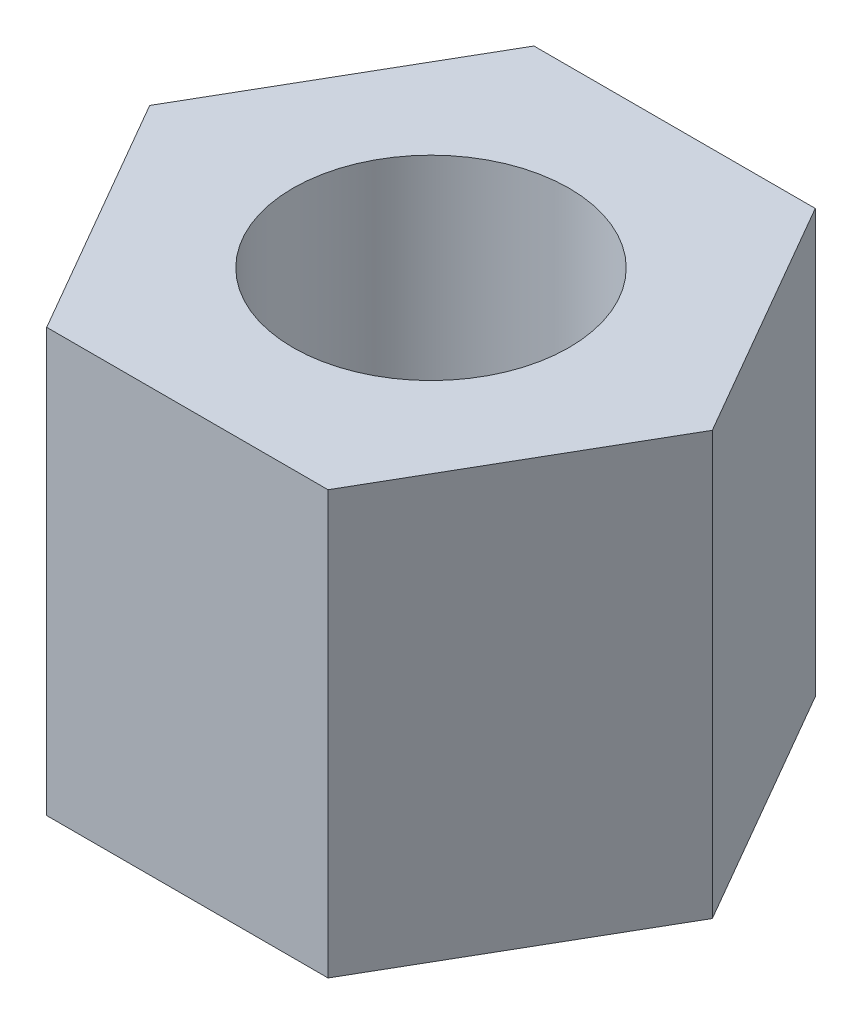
ISO-10303-21;
HEADER;
FILE_DESCRIPTION(('STEP AP214'),'2;1');
FILE_NAME('part.step','',(''),(''),'','','');
FILE_SCHEMA(('AUTOMOTIVE_DESIGN { 1 0 10303 214 1 1 1 1 }'));
ENDSEC;
DATA;
#1=APPLICATION_CONTEXT('core data for automotive mechanical design processes');
#2=APPLICATION_PROTOCOL_DEFINITION('international standard','automotive_design',2000,#1);
#3=PRODUCT_CONTEXT('',#1,'mechanical');
#4=PRODUCT('Part','Part','',(#3));
#5=PRODUCT_RELATED_PRODUCT_CATEGORY('part','',(#4));
#6=PRODUCT_DEFINITION_FORMATION('','',#4);
#7=PRODUCT_DEFINITION_CONTEXT('part definition',#1,'design');
#8=PRODUCT_DEFINITION('design','',#6,#7);
#9=PRODUCT_DEFINITION_SHAPE('','',#8);
#10=(LENGTH_UNIT() NAMED_UNIT(*) SI_UNIT(.MILLI.,.METRE.));
#11=(NAMED_UNIT(*) PLANE_ANGLE_UNIT() SI_UNIT($,.RADIAN.));
#12=(NAMED_UNIT(*) SI_UNIT($,.STERADIAN.) SOLID_ANGLE_UNIT());
#13=UNCERTAINTY_MEASURE_WITH_UNIT(LENGTH_MEASURE(1.E-05),#10,'distance_accuracy_value','');
#14=(GEOMETRIC_REPRESENTATION_CONTEXT(3) GLOBAL_UNCERTAINTY_ASSIGNED_CONTEXT((#13)) GLOBAL_UNIT_ASSIGNED_CONTEXT((#10,
#11,#12)) REPRESENTATION_CONTEXT('',''));
#15=CARTESIAN_POINT('',(0.,0.,0.));
#16=DIRECTION('',(0.,0.,1.));
#17=DIRECTION('',(1.,0.,0.));
#18=AXIS2_PLACEMENT_3D('',#15,#16,#17);
#19=CARTESIAN_POINT('',(6.92820323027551,0.,0.));
#20=DIRECTION('',(0.,-1.,0.));
#21=DIRECTION('',(0.,0.,-1.));
#22=AXIS2_PLACEMENT_3D('',#19,#20,#21);
#23=PLANE('',#22);
#24=DIRECTION('',(-0.5,0.,-0.866025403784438));
#25=VECTOR('',#24,1.);
#26=CARTESIAN_POINT('',(6.92820323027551,0.,0.));
#27=LINE('',#26,#25);
#28=CARTESIAN_POINT('',(6.92820323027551,0.,0.));
#29=VERTEX_POINT('',#28);
#30=CARTESIAN_POINT('',(3.46410161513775,0.,-6.));
#31=VERTEX_POINT('',#30);
#32=EDGE_CURVE('E119',#29,#31,#27,.T.);
#33=ORIENTED_EDGE('',*,*,#32,.F.);
#34=DIRECTION('',(0.5,0.,-0.866025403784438));
#35=VECTOR('',#34,1.);
#36=CARTESIAN_POINT('',(3.46410161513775,0.,6.));
#37=LINE('',#36,#35);
#38=CARTESIAN_POINT('',(3.46410161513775,0.,6.));
#39=VERTEX_POINT('',#38);
#40=EDGE_CURVE('E80',#39,#29,#37,.T.);
#41=ORIENTED_EDGE('',*,*,#40,.F.);
#42=DIRECTION('',(1.,0.,0.));
#43=VECTOR('',#42,1.);
#44=CARTESIAN_POINT('',(-3.46410161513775,0.,6.));
#45=LINE('',#44,#43);
#46=CARTESIAN_POINT('',(-3.46410161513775,0.,6.));
#47=VERTEX_POINT('',#46);
#48=EDGE_CURVE('E74',#47,#39,#45,.T.);
#49=ORIENTED_EDGE('',*,*,#48,.F.);
#50=DIRECTION('',(0.5,0.,0.866025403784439));
#51=VECTOR('',#50,1.);
#52=CARTESIAN_POINT('',(-6.92820323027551,0.,0.));
#53=LINE('',#52,#51);
#54=CARTESIAN_POINT('',(-6.92820323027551,0.,0.));
#55=VERTEX_POINT('',#54);
#56=EDGE_CURVE('E109',#55,#47,#53,.T.);
#57=ORIENTED_EDGE('',*,*,#56,.F.);
#58=DIRECTION('',(-0.5,0.,0.866025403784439));
#59=VECTOR('',#58,1.);
#60=CARTESIAN_POINT('',(-3.46410161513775,0.,-6.));
#61=LINE('',#60,#59);
#62=CARTESIAN_POINT('',(-3.46410161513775,0.,-6.));
#63=VERTEX_POINT('',#62);
#64=EDGE_CURVE('E125',#63,#55,#61,.T.);
#65=ORIENTED_EDGE('',*,*,#64,.F.);
#66=DIRECTION('',(-1.,0.,0.));
#67=VECTOR('',#66,1.);
#68=CARTESIAN_POINT('',(3.46410161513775,0.,-6.));
#69=LINE('',#68,#67);
#70=EDGE_CURVE('E122',#31,#63,#69,.T.);
#71=ORIENTED_EDGE('',*,*,#70,.F.);
#72=EDGE_LOOP('',(#33,#41,#49,#57,#65,#71));
#73=FACE_BOUND('',#72,.T.);
#74=CARTESIAN_POINT('',(0.,0.,0.));
#75=DIRECTION('',(0.,1.,0.));
#76=DIRECTION('',(0.,0.,1.));
#77=AXIS2_PLACEMENT_3D('',#74,#75,#76);
#78=CIRCLE('',#77,3.4);
#79=CARTESIAN_POINT('',(0.,0.,3.4));
#80=VERTEX_POINT('',#79);
#81=EDGE_CURVE('E168',#80,#80,#78,.T.);
#82=ORIENTED_EDGE('',*,*,#81,.T.);
#83=EDGE_LOOP('',(#82));
#84=FACE_BOUND('',#83,.T.);
#85=ADVANCED_FACE('F34',(#73,#84),#23,.T.);
#86=CARTESIAN_POINT('',(6.92820323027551,10.414,0.));
#87=DIRECTION('',(-0.866025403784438,0.,0.5));
#88=DIRECTION('',(0.5,0.,0.866025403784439));
#89=AXIS2_PLACEMENT_3D('',#86,#87,#88);
#90=PLANE('',#89);
#91=ORIENTED_EDGE('',*,*,#32,.T.);
#92=DIRECTION('',(0.,-1.,0.));
#93=VECTOR('',#92,1.);
#94=CARTESIAN_POINT('',(3.46410161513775,10.414,-6.));
#95=LINE('',#94,#93);
#96=CARTESIAN_POINT('',(3.46410161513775,10.414,-6.));
#97=VERTEX_POINT('',#96);
#98=EDGE_CURVE('E11',#97,#31,#95,.T.);
#99=ORIENTED_EDGE('',*,*,#98,.F.);
#100=DIRECTION('',(-0.5,0.,-0.866025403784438));
#101=VECTOR('',#100,1.);
#102=CARTESIAN_POINT('',(6.92820323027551,10.414,0.));
#103=LINE('',#102,#101);
#104=CARTESIAN_POINT('',(6.92820323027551,10.414,0.));
#105=VERTEX_POINT('',#104);
#106=EDGE_CURVE('E130',#105,#97,#103,.T.);
#107=ORIENTED_EDGE('',*,*,#106,.F.);
#108=DIRECTION('',(0.,-1.,0.));
#109=VECTOR('',#108,1.);
#110=CARTESIAN_POINT('',(6.92820323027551,10.414,0.));
#111=LINE('',#110,#109);
#112=EDGE_CURVE('E115',#105,#29,#111,.T.);
#113=ORIENTED_EDGE('',*,*,#112,.T.);
#114=EDGE_LOOP('',(#91,#99,#107,#113));
#115=FACE_BOUND('',#114,.T.);
#116=ADVANCED_FACE('F36',(#115),#90,.F.);
#117=CARTESIAN_POINT('',(3.46410161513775,10.414,-6.));
#118=DIRECTION('',(0.,0.,1.));
#119=DIRECTION('',(1.,0.,0.));
#120=AXIS2_PLACEMENT_3D('',#117,#118,#119);
#121=PLANE('',#120);
#122=ORIENTED_EDGE('',*,*,#70,.T.);
#123=DIRECTION('',(0.,-1.,0.));
#124=VECTOR('',#123,1.);
#125=CARTESIAN_POINT('',(-3.46410161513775,10.414,-6.));
#126=LINE('',#125,#124);
#127=CARTESIAN_POINT('',(-3.46410161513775,10.414,-6.));
#128=VERTEX_POINT('',#127);
#129=EDGE_CURVE('E43',#128,#63,#126,.T.);
#130=ORIENTED_EDGE('',*,*,#129,.F.);
#131=DIRECTION('',(-1.,0.,0.));
#132=VECTOR('',#131,1.);
#133=CARTESIAN_POINT('',(3.46410161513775,10.414,-6.));
#134=LINE('',#133,#132);
#135=EDGE_CURVE('E88',#97,#128,#134,.T.);
#136=ORIENTED_EDGE('',*,*,#135,.F.);
#137=ORIENTED_EDGE('',*,*,#98,.T.);
#138=EDGE_LOOP('',(#122,#130,#136,#137));
#139=FACE_BOUND('',#138,.T.);
#140=ADVANCED_FACE('F159',(#139),#121,.F.);
#141=CARTESIAN_POINT('',(-3.46410161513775,10.414,-6.));
#142=DIRECTION('',(0.866025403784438,0.,0.5));
#143=DIRECTION('',(0.5,0.,-0.866025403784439));
#144=AXIS2_PLACEMENT_3D('',#141,#142,#143);
#145=PLANE('',#144);
#146=ORIENTED_EDGE('',*,*,#64,.T.);
#147=DIRECTION('',(0.,-1.,0.));
#148=VECTOR('',#147,1.);
#149=CARTESIAN_POINT('',(-6.92820323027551,10.414,0.));
#150=LINE('',#149,#148);
#151=CARTESIAN_POINT('',(-6.92820323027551,10.414,0.));
#152=VERTEX_POINT('',#151);
#153=EDGE_CURVE('E110',#152,#55,#150,.T.);
#154=ORIENTED_EDGE('',*,*,#153,.F.);
#155=DIRECTION('',(-0.5,0.,0.866025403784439));
#156=VECTOR('',#155,1.);
#157=CARTESIAN_POINT('',(-3.46410161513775,10.414,-6.));
#158=LINE('',#157,#156);
#159=EDGE_CURVE('E101',#128,#152,#158,.T.);
#160=ORIENTED_EDGE('',*,*,#159,.F.);
#161=ORIENTED_EDGE('',*,*,#129,.T.);
#162=EDGE_LOOP('',(#146,#154,#160,#161));
#163=FACE_BOUND('',#162,.T.);
#164=ADVANCED_FACE('F136',(#163),#145,.F.);
#165=CARTESIAN_POINT('',(-6.92820323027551,10.414,0.));
#166=DIRECTION('',(0.866025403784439,0.,-0.5));
#167=DIRECTION('',(-0.5,0.,-0.866025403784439));
#168=AXIS2_PLACEMENT_3D('',#165,#166,#167);
#169=PLANE('',#168);
#170=ORIENTED_EDGE('',*,*,#56,.T.);
#171=DIRECTION('',(0.,-1.,0.));
#172=VECTOR('',#171,1.);
#173=CARTESIAN_POINT('',(-3.46410161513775,10.414,6.));
#174=LINE('',#173,#172);
#175=CARTESIAN_POINT('',(-3.46410161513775,10.414,6.));
#176=VERTEX_POINT('',#175);
#177=EDGE_CURVE('E106',#176,#47,#174,.T.);
#178=ORIENTED_EDGE('',*,*,#177,.F.);
#179=DIRECTION('',(0.5,0.,0.866025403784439));
#180=VECTOR('',#179,1.);
#181=CARTESIAN_POINT('',(-6.92820323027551,10.414,0.));
#182=LINE('',#181,#180);
#183=EDGE_CURVE('E95',#152,#176,#182,.T.);
#184=ORIENTED_EDGE('',*,*,#183,.F.);
#185=ORIENTED_EDGE('',*,*,#153,.T.);
#186=EDGE_LOOP('',(#170,#178,#184,#185));
#187=FACE_BOUND('',#186,.T.);
#188=ADVANCED_FACE('F107',(#187),#169,.F.);
#189=CARTESIAN_POINT('',(-3.46410161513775,10.414,6.));
#190=DIRECTION('',(0.,0.,-1.));
#191=DIRECTION('',(-1.,0.,0.));
#192=AXIS2_PLACEMENT_3D('',#189,#190,#191);
#193=PLANE('',#192);
#194=ORIENTED_EDGE('',*,*,#48,.T.);
#195=DIRECTION('',(0.,-1.,0.));
#196=VECTOR('',#195,1.);
#197=CARTESIAN_POINT('',(3.46410161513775,10.414,6.));
#198=LINE('',#197,#196);
#199=CARTESIAN_POINT('',(3.46410161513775,10.414,6.));
#200=VERTEX_POINT('',#199);
#201=EDGE_CURVE('E111',#200,#39,#198,.T.);
#202=ORIENTED_EDGE('',*,*,#201,.F.);
#203=DIRECTION('',(1.,0.,0.));
#204=VECTOR('',#203,1.);
#205=CARTESIAN_POINT('',(-3.46410161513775,10.414,6.));
#206=LINE('',#205,#204);
#207=EDGE_CURVE('E99',#176,#200,#206,.T.);
#208=ORIENTED_EDGE('',*,*,#207,.F.);
#209=ORIENTED_EDGE('',*,*,#177,.T.);
#210=EDGE_LOOP('',(#194,#202,#208,#209));
#211=FACE_BOUND('',#210,.T.);
#212=ADVANCED_FACE('F113',(#211),#193,.F.);
#213=CARTESIAN_POINT('',(3.46410161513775,10.414,6.));
#214=DIRECTION('',(-0.866025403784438,0.,-0.5));
#215=DIRECTION('',(-0.5,0.,0.866025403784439));
#216=AXIS2_PLACEMENT_3D('',#213,#214,#215);
#217=PLANE('',#216);
#218=ORIENTED_EDGE('',*,*,#40,.T.);
#219=ORIENTED_EDGE('',*,*,#112,.F.);
#220=DIRECTION('',(0.5,0.,-0.866025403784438));
#221=VECTOR('',#220,1.);
#222=CARTESIAN_POINT('',(3.46410161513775,10.414,6.));
#223=LINE('',#222,#221);
#224=EDGE_CURVE('E51',#200,#105,#223,.T.);
#225=ORIENTED_EDGE('',*,*,#224,.F.);
#226=ORIENTED_EDGE('',*,*,#201,.T.);
#227=EDGE_LOOP('',(#218,#219,#225,#226));
#228=FACE_BOUND('',#227,.T.);
#229=ADVANCED_FACE('F143',(#228),#217,.F.);
#230=CARTESIAN_POINT('',(6.92820323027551,10.414,0.));
#231=DIRECTION('',(0.,-1.,0.));
#232=DIRECTION('',(0.,0.,-1.));
#233=AXIS2_PLACEMENT_3D('',#230,#231,#232);
#234=PLANE('',#233);
#235=CARTESIAN_POINT('',(0.,10.414,0.));
#236=DIRECTION('',(0.,1.,0.));
#237=DIRECTION('',(0.,0.,1.));
#238=AXIS2_PLACEMENT_3D('',#235,#236,#237);
#239=CIRCLE('',#238,3.39999999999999);
#240=CARTESIAN_POINT('',(0.,10.414,3.39999999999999));
#241=VERTEX_POINT('',#240);
#242=EDGE_CURVE('E123',#241,#241,#239,.T.);
#243=ORIENTED_EDGE('',*,*,#242,.F.);
#244=EDGE_LOOP('',(#243));
#245=FACE_BOUND('',#244,.T.);
#246=ORIENTED_EDGE('',*,*,#106,.T.);
#247=ORIENTED_EDGE('',*,*,#135,.T.);
#248=ORIENTED_EDGE('',*,*,#159,.T.);
#249=ORIENTED_EDGE('',*,*,#183,.T.);
#250=ORIENTED_EDGE('',*,*,#207,.T.);
#251=ORIENTED_EDGE('',*,*,#224,.T.);
#252=EDGE_LOOP('',(#246,#247,#248,#249,#250,#251));
#253=FACE_BOUND('',#252,.T.);
#254=ADVANCED_FACE('F97',(#245,#253),#234,.F.);
#255=CARTESIAN_POINT('',(0.,10.414,0.));
#256=DIRECTION('',(0.,1.,0.));
#257=DIRECTION('',(0.,0.,1.));
#258=AXIS2_PLACEMENT_3D('',#255,#256,#257);
#259=CYLINDRICAL_SURFACE('',#258,3.39999999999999);
#260=ORIENTED_EDGE('',*,*,#81,.F.);
#261=EDGE_LOOP('',(#260));
#262=FACE_BOUND('',#261,.T.);
#263=ORIENTED_EDGE('',*,*,#242,.T.);
#264=EDGE_LOOP('',(#263));
#265=FACE_BOUND('',#264,.T.);
#266=ADVANCED_FACE('F150',(#262,#265),#259,.F.);
#267=CLOSED_SHELL('',(#85,#116,#140,#164,#188,#212,#229,#254,#266));
#268=MANIFOLD_SOLID_BREP('B2',#267);
#269=ADVANCED_BREP_SHAPE_REPRESENTATION('',(#18,#268),#14);
#270=SHAPE_DEFINITION_REPRESENTATION(#9,#269);
ENDSEC;
END-ISO-10303-21;
